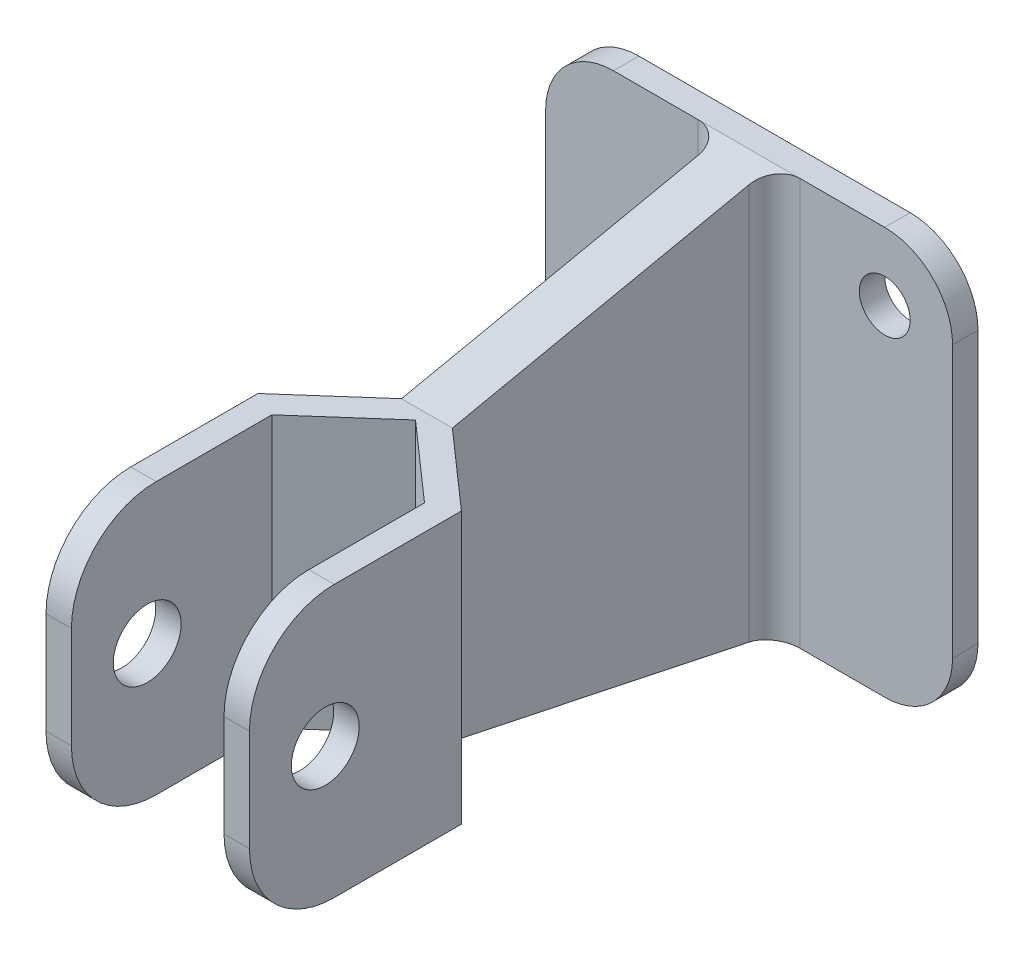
ISO-10303-21;
HEADER;
FILE_DESCRIPTION(('STEP AP214'),'2;1');
FILE_NAME('part.step','',(''),(''),'','','');
FILE_SCHEMA(('AUTOMOTIVE_DESIGN { 1 0 10303 214 1 1 1 1 }'));
ENDSEC;
DATA;
#1=APPLICATION_CONTEXT('core data for automotive mechanical design processes');
#2=APPLICATION_PROTOCOL_DEFINITION('international standard','automotive_design',2000,#1);
#3=PRODUCT_CONTEXT('',#1,'mechanical');
#4=PRODUCT('Part','Part','',(#3));
#5=PRODUCT_RELATED_PRODUCT_CATEGORY('part','',(#4));
#6=PRODUCT_DEFINITION_FORMATION('','',#4);
#7=PRODUCT_DEFINITION_CONTEXT('part definition',#1,'design');
#8=PRODUCT_DEFINITION('design','',#6,#7);
#9=PRODUCT_DEFINITION_SHAPE('','',#8);
#10=(LENGTH_UNIT() NAMED_UNIT(*) SI_UNIT(.MILLI.,.METRE.));
#11=(NAMED_UNIT(*) PLANE_ANGLE_UNIT() SI_UNIT($,.RADIAN.));
#12=(NAMED_UNIT(*) SI_UNIT($,.STERADIAN.) SOLID_ANGLE_UNIT());
#13=UNCERTAINTY_MEASURE_WITH_UNIT(LENGTH_MEASURE(1.E-05),#10,'distance_accuracy_value','');
#14=(GEOMETRIC_REPRESENTATION_CONTEXT(3) GLOBAL_UNCERTAINTY_ASSIGNED_CONTEXT((#13)) GLOBAL_UNIT_ASSIGNED_CONTEXT((#10,
#11,#12)) REPRESENTATION_CONTEXT('',''));
#15=CARTESIAN_POINT('',(0.,0.,0.));
#16=DIRECTION('',(0.,0.,1.));
#17=DIRECTION('',(1.,0.,0.));
#18=AXIS2_PLACEMENT_3D('',#15,#16,#17);
#19=CARTESIAN_POINT('',(0.,-48.,3.));
#20=DIRECTION('',(0.,0.,1.));
#21=DIRECTION('',(1.,0.,0.));
#22=AXIS2_PLACEMENT_3D('',#19,#20,#21);
#23=PLANE('',#22);
#24=CARTESIAN_POINT('',(8.00000000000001,-40.,3.));
#25=DIRECTION('',(0.,0.,1.));
#26=DIRECTION('',(1.,0.,0.));
#27=AXIS2_PLACEMENT_3D('',#24,#25,#26);
#28=CIRCLE('',#27,3.);
#29=CARTESIAN_POINT('',(11.,-40.,3.));
#30=VERTEX_POINT('',#29);
#31=EDGE_CURVE('E517',#30,#30,#28,.T.);
#32=ORIENTED_EDGE('',*,*,#31,.F.);
#33=EDGE_LOOP('',(#32));
#34=FACE_BOUND('',#33,.T.);
#35=DIRECTION('',(-1.,0.,0.));
#36=VECTOR('',#35,1.);
#37=CARTESIAN_POINT('',(0.,0.,3.));
#38=LINE('',#37,#36);
#39=CARTESIAN_POINT('',(18.,0.,3.));
#40=VERTEX_POINT('',#39);
#41=CARTESIAN_POINT('',(8.,0.,3.));
#42=VERTEX_POINT('',#41);
#43=EDGE_CURVE('E321',#40,#42,#38,.T.);
#44=ORIENTED_EDGE('',*,*,#43,.T.);
#45=CARTESIAN_POINT('',(8.,-8.,3.));
#46=DIRECTION('',(0.,0.,1.));
#47=DIRECTION('',(1.,0.,0.));
#48=AXIS2_PLACEMENT_3D('',#45,#46,#47);
#49=CIRCLE('',#48,8.);
#50=CARTESIAN_POINT('',(0.,-8.,3.));
#51=VERTEX_POINT('',#50);
#52=EDGE_CURVE('E11',#42,#51,#49,.T.);
#53=ORIENTED_EDGE('',*,*,#52,.T.);
#54=DIRECTION('',(0.,-1.,0.));
#55=VECTOR('',#54,1.);
#56=CARTESIAN_POINT('',(0.,0.,3.));
#57=LINE('',#56,#55);
#58=CARTESIAN_POINT('',(0.,-40.,3.));
#59=VERTEX_POINT('',#58);
#60=EDGE_CURVE('E343',#51,#59,#57,.T.);
#61=ORIENTED_EDGE('',*,*,#60,.T.);
#62=CARTESIAN_POINT('',(8.00000000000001,-40.,3.));
#63=DIRECTION('',(0.,0.,1.));
#64=DIRECTION('',(1.,0.,0.));
#65=AXIS2_PLACEMENT_3D('',#62,#63,#64);
#66=CIRCLE('',#65,8.);
#67=CARTESIAN_POINT('',(8.00000000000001,-48.,3.));
#68=VERTEX_POINT('',#67);
#69=EDGE_CURVE('E362',#59,#68,#66,.T.);
#70=ORIENTED_EDGE('',*,*,#69,.T.);
#71=DIRECTION('',(1.,0.,0.));
#72=VECTOR('',#71,1.);
#73=CARTESIAN_POINT('',(0.,-48.,3.));
#74=LINE('',#73,#72);
#75=CARTESIAN_POINT('',(18.,-48.,3.));
#76=VERTEX_POINT('',#75);
#77=EDGE_CURVE('E342',#68,#76,#74,.T.);
#78=ORIENTED_EDGE('',*,*,#77,.T.);
#79=DIRECTION('',(0.,1.,0.));
#80=VECTOR('',#79,1.);
#81=CARTESIAN_POINT('',(18.,-48.,3.));
#82=LINE('',#81,#80);
#83=EDGE_CURVE('E271',#76,#40,#82,.T.);
#84=ORIENTED_EDGE('',*,*,#83,.T.);
#85=EDGE_LOOP('',(#44,#53,#61,#70,#78,#84));
#86=FACE_BOUND('',#85,.T.);
#87=ADVANCED_FACE('F33',(#34,#86),#23,.T.);
#88=CARTESIAN_POINT('',(0.,0.,3.));
#89=DIRECTION('',(1.,0.,0.));
#90=DIRECTION('',(0.,1.,0.));
#91=AXIS2_PLACEMENT_3D('',#88,#89,#90);
#92=PLANE('',#91);
#93=ORIENTED_EDGE('',*,*,#60,.F.);
#94=DIRECTION('',(0.,0.,-1.));
#95=VECTOR('',#94,1.);
#96=CARTESIAN_POINT('',(0.,-8.,3.));
#97=LINE('',#96,#95);
#98=CARTESIAN_POINT('',(0.,-8.,0.));
#99=VERTEX_POINT('',#98);
#100=EDGE_CURVE('E364',#51,#99,#97,.T.);
#101=ORIENTED_EDGE('',*,*,#100,.T.);
#102=DIRECTION('',(0.,-1.,0.));
#103=VECTOR('',#102,1.);
#104=CARTESIAN_POINT('',(0.,0.,0.));
#105=LINE('',#104,#103);
#106=CARTESIAN_POINT('',(0.,-40.,0.));
#107=VERTEX_POINT('',#106);
#108=EDGE_CURVE('E370',#99,#107,#105,.T.);
#109=ORIENTED_EDGE('',*,*,#108,.T.);
#110=DIRECTION('',(0.,0.,-1.));
#111=VECTOR('',#110,1.);
#112=CARTESIAN_POINT('',(0.,-40.,3.));
#113=LINE('',#112,#111);
#114=EDGE_CURVE('E359',#107,#59,#113,.F.);
#115=ORIENTED_EDGE('',*,*,#114,.T.);
#116=EDGE_LOOP('',(#93,#101,#109,#115));
#117=FACE_BOUND('',#116,.T.);
#118=ADVANCED_FACE('F35',(#117),#92,.F.);
#119=CARTESIAN_POINT('',(0.,-48.,3.));
#120=DIRECTION('',(0.,1.,0.));
#121=DIRECTION('',(0.,0.,1.));
#122=AXIS2_PLACEMENT_3D('',#119,#120,#121);
#123=PLANE('',#122);
#124=ORIENTED_EDGE('',*,*,#77,.F.);
#125=DIRECTION('',(0.,0.,-1.));
#126=VECTOR('',#125,1.);
#127=CARTESIAN_POINT('',(8.00000000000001,-48.,3.));
#128=LINE('',#127,#126);
#129=CARTESIAN_POINT('',(8.00000000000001,-48.,0.));
#130=VERTEX_POINT('',#129);
#131=EDGE_CURVE('E353',#68,#130,#128,.T.);
#132=ORIENTED_EDGE('',*,*,#131,.T.);
#133=DIRECTION('',(1.,0.,0.));
#134=VECTOR('',#133,1.);
#135=CARTESIAN_POINT('',(0.,-48.,0.));
#136=LINE('',#135,#134);
#137=CARTESIAN_POINT('',(40.,-48.,0.));
#138=VERTEX_POINT('',#137);
#139=EDGE_CURVE('E376',#130,#138,#136,.T.);
#140=ORIENTED_EDGE('',*,*,#139,.T.);
#141=DIRECTION('',(0.,0.,-1.));
#142=VECTOR('',#141,1.);
#143=CARTESIAN_POINT('',(40.,-48.,3.));
#144=LINE('',#143,#142);
#145=CARTESIAN_POINT('',(40.,-48.,3.));
#146=VERTEX_POINT('',#145);
#147=EDGE_CURVE('E402',#138,#146,#144,.F.);
#148=ORIENTED_EDGE('',*,*,#147,.T.);
#149=CARTESIAN_POINT('',(30.,-48.,3.));
#150=VERTEX_POINT('',#149);
#151=EDGE_CURVE('E340',#150,#146,#74,.T.);
#152=ORIENTED_EDGE('',*,*,#151,.F.);
#153=DIRECTION('',(-1.,0.,0.));
#154=VECTOR('',#153,1.);
#155=CARTESIAN_POINT('',(27.,-48.,3.));
#156=LINE('',#155,#154);
#157=EDGE_CURVE('E377',#150,#76,#156,.T.);
#158=ORIENTED_EDGE('',*,*,#157,.T.);
#159=EDGE_LOOP('',(#124,#132,#140,#148,#152,#158));
#160=FACE_BOUND('',#159,.T.);
#161=ADVANCED_FACE('F393',(#160),#123,.F.);
#162=CARTESIAN_POINT('',(48.,0.,3.));
#163=DIRECTION('',(-1.,0.,0.));
#164=DIRECTION('',(0.,-1.,0.));
#165=AXIS2_PLACEMENT_3D('',#162,#163,#164);
#166=PLANE('',#165);
#167=DIRECTION('',(0.,1.,0.));
#168=VECTOR('',#167,1.);
#169=CARTESIAN_POINT('',(48.,0.,3.));
#170=LINE('',#169,#168);
#171=CARTESIAN_POINT('',(48.,-40.,3.));
#172=VERTEX_POINT('',#171);
#173=CARTESIAN_POINT('',(48.,-8.,3.));
#174=VERTEX_POINT('',#173);
#175=EDGE_CURVE('E326',#172,#174,#170,.T.);
#176=ORIENTED_EDGE('',*,*,#175,.F.);
#177=DIRECTION('',(0.,0.,-1.));
#178=VECTOR('',#177,1.);
#179=CARTESIAN_POINT('',(48.,-40.,3.));
#180=LINE('',#179,#178);
#181=CARTESIAN_POINT('',(48.,-40.,0.));
#182=VERTEX_POINT('',#181);
#183=EDGE_CURVE('E403',#172,#182,#180,.T.);
#184=ORIENTED_EDGE('',*,*,#183,.T.);
#185=DIRECTION('',(0.,1.,0.));
#186=VECTOR('',#185,1.);
#187=CARTESIAN_POINT('',(48.,0.,0.));
#188=LINE('',#187,#186);
#189=CARTESIAN_POINT('',(48.,-8.,0.));
#190=VERTEX_POINT('',#189);
#191=EDGE_CURVE('E379',#182,#190,#188,.T.);
#192=ORIENTED_EDGE('',*,*,#191,.T.);
#193=DIRECTION('',(0.,0.,-1.));
#194=VECTOR('',#193,1.);
#195=CARTESIAN_POINT('',(48.,-8.,3.));
#196=LINE('',#195,#194);
#197=EDGE_CURVE('E412',#190,#174,#196,.F.);
#198=ORIENTED_EDGE('',*,*,#197,.T.);
#199=EDGE_LOOP('',(#176,#184,#192,#198));
#200=FACE_BOUND('',#199,.T.);
#201=ADVANCED_FACE('F425',(#200),#166,.F.);
#202=CARTESIAN_POINT('',(0.,0.,3.));
#203=DIRECTION('',(0.,-1.,0.));
#204=DIRECTION('',(0.,0.,-1.));
#205=AXIS2_PLACEMENT_3D('',#202,#203,#204);
#206=PLANE('',#205);
#207=DIRECTION('',(-1.,0.,0.));
#208=VECTOR('',#207,1.);
#209=CARTESIAN_POINT('',(0.,0.,0.));
#210=LINE('',#209,#208);
#211=CARTESIAN_POINT('',(40.,0.,0.));
#212=VERTEX_POINT('',#211);
#213=CARTESIAN_POINT('',(8.,0.,0.));
#214=VERTEX_POINT('',#213);
#215=EDGE_CURVE('E384',#212,#214,#210,.T.);
#216=ORIENTED_EDGE('',*,*,#215,.T.);
#217=DIRECTION('',(0.,0.,-1.));
#218=VECTOR('',#217,1.);
#219=CARTESIAN_POINT('',(8.,0.,3.));
#220=LINE('',#219,#218);
#221=EDGE_CURVE('E41',#214,#42,#220,.F.);
#222=ORIENTED_EDGE('',*,*,#221,.T.);
#223=ORIENTED_EDGE('',*,*,#43,.F.);
#224=DIRECTION('',(-1.,0.,0.));
#225=VECTOR('',#224,1.);
#226=CARTESIAN_POINT('',(27.,0.,3.));
#227=LINE('',#226,#225);
#228=CARTESIAN_POINT('',(30.,0.,3.));
#229=VERTEX_POINT('',#228);
#230=EDGE_CURVE('E328',#229,#40,#227,.T.);
#231=ORIENTED_EDGE('',*,*,#230,.F.);
#232=CARTESIAN_POINT('',(40.,0.,3.));
#233=VERTEX_POINT('',#232);
#234=EDGE_CURVE('E317',#233,#229,#38,.T.);
#235=ORIENTED_EDGE('',*,*,#234,.F.);
#236=DIRECTION('',(0.,0.,-1.));
#237=VECTOR('',#236,1.);
#238=CARTESIAN_POINT('',(40.,0.,3.));
#239=LINE('',#238,#237);
#240=EDGE_CURVE('E316',#233,#212,#239,.T.);
#241=ORIENTED_EDGE('',*,*,#240,.T.);
#242=EDGE_LOOP('',(#216,#222,#223,#231,#235,#241));
#243=FACE_BOUND('',#242,.T.);
#244=ADVANCED_FACE('F418',(#243),#206,.F.);
#245=CARTESIAN_POINT('',(40.,-8.,3.));
#246=DIRECTION('',(0.,0.,1.));
#247=DIRECTION('',(1.,0.,0.));
#248=AXIS2_PLACEMENT_3D('',#245,#246,#247);
#249=CIRCLE('',#248,3.);
#250=CARTESIAN_POINT('',(43.,-8.,3.));
#251=VERTEX_POINT('',#250);
#252=EDGE_CURVE('E511',#251,#251,#249,.T.);
#253=ORIENTED_EDGE('',*,*,#252,.F.);
#254=EDGE_LOOP('',(#253));
#255=FACE_BOUND('',#254,.T.);
#256=ORIENTED_EDGE('',*,*,#151,.T.);
#257=CARTESIAN_POINT('',(40.,-40.,3.));
#258=DIRECTION('',(0.,0.,1.));
#259=DIRECTION('',(1.,0.,0.));
#260=AXIS2_PLACEMENT_3D('',#257,#258,#259);
#261=CIRCLE('',#260,8.);
#262=EDGE_CURVE('E351',#146,#172,#261,.T.);
#263=ORIENTED_EDGE('',*,*,#262,.T.);
#264=ORIENTED_EDGE('',*,*,#175,.T.);
#265=CARTESIAN_POINT('',(40.,-8.,3.));
#266=DIRECTION('',(0.,0.,1.));
#267=DIRECTION('',(1.,0.,0.));
#268=AXIS2_PLACEMENT_3D('',#265,#266,#267);
#269=CIRCLE('',#268,8.);
#270=EDGE_CURVE('E410',#174,#233,#269,.T.);
#271=ORIENTED_EDGE('',*,*,#270,.T.);
#272=ORIENTED_EDGE('',*,*,#234,.T.);
#273=DIRECTION('',(0.,1.,0.));
#274=VECTOR('',#273,1.);
#275=CARTESIAN_POINT('',(30.,-48.,3.));
#276=LINE('',#275,#274);
#277=EDGE_CURVE('E337',#229,#150,#276,.F.);
#278=ORIENTED_EDGE('',*,*,#277,.T.);
#279=EDGE_LOOP('',(#256,#263,#264,#271,#272,#278));
#280=FACE_BOUND('',#279,.T.);
#281=ADVANCED_FACE('F427',(#255,#280),#23,.T.);
#282=CARTESIAN_POINT('',(0.,-48.,0.));
#283=DIRECTION('',(0.,0.,1.));
#284=DIRECTION('',(1.,0.,0.));
#285=AXIS2_PLACEMENT_3D('',#282,#283,#284);
#286=PLANE('',#285);
#287=CARTESIAN_POINT('',(8.00000000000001,-40.,0.));
#288=DIRECTION('',(0.,0.,1.));
#289=DIRECTION('',(1.,0.,0.));
#290=AXIS2_PLACEMENT_3D('',#287,#288,#289);
#291=CIRCLE('',#290,3.);
#292=CARTESIAN_POINT('',(11.,-40.,0.));
#293=VERTEX_POINT('',#292);
#294=EDGE_CURVE('E514',#293,#293,#291,.T.);
#295=ORIENTED_EDGE('',*,*,#294,.T.);
#296=EDGE_LOOP('',(#295));
#297=FACE_BOUND('',#296,.T.);
#298=CARTESIAN_POINT('',(40.,-8.,0.));
#299=DIRECTION('',(0.,0.,1.));
#300=DIRECTION('',(1.,0.,0.));
#301=AXIS2_PLACEMENT_3D('',#298,#299,#300);
#302=CIRCLE('',#301,3.);
#303=CARTESIAN_POINT('',(43.,-8.,0.));
#304=VERTEX_POINT('',#303);
#305=EDGE_CURVE('E508',#304,#304,#302,.T.);
#306=ORIENTED_EDGE('',*,*,#305,.T.);
#307=EDGE_LOOP('',(#306));
#308=FACE_BOUND('',#307,.T.);
#309=ORIENTED_EDGE('',*,*,#108,.F.);
#310=CARTESIAN_POINT('',(8.,-8.,0.));
#311=DIRECTION('',(0.,0.,1.));
#312=DIRECTION('',(1.,0.,0.));
#313=AXIS2_PLACEMENT_3D('',#310,#311,#312);
#314=CIRCLE('',#313,8.);
#315=EDGE_CURVE('E55',#99,#214,#314,.F.);
#316=ORIENTED_EDGE('',*,*,#315,.T.);
#317=ORIENTED_EDGE('',*,*,#215,.F.);
#318=CARTESIAN_POINT('',(40.,-8.,0.));
#319=DIRECTION('',(0.,0.,1.));
#320=DIRECTION('',(1.,0.,0.));
#321=AXIS2_PLACEMENT_3D('',#318,#319,#320);
#322=CIRCLE('',#321,8.);
#323=EDGE_CURVE('E414',#212,#190,#322,.F.);
#324=ORIENTED_EDGE('',*,*,#323,.T.);
#325=ORIENTED_EDGE('',*,*,#191,.F.);
#326=CARTESIAN_POINT('',(40.,-40.,0.));
#327=DIRECTION('',(0.,0.,1.));
#328=DIRECTION('',(1.,0.,0.));
#329=AXIS2_PLACEMENT_3D('',#326,#327,#328);
#330=CIRCLE('',#329,8.);
#331=EDGE_CURVE('E396',#182,#138,#330,.F.);
#332=ORIENTED_EDGE('',*,*,#331,.T.);
#333=ORIENTED_EDGE('',*,*,#139,.F.);
#334=CARTESIAN_POINT('',(8.00000000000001,-40.,0.));
#335=DIRECTION('',(0.,0.,1.));
#336=DIRECTION('',(1.,0.,0.));
#337=AXIS2_PLACEMENT_3D('',#334,#335,#336);
#338=CIRCLE('',#337,8.);
#339=EDGE_CURVE('E356',#130,#107,#338,.F.);
#340=ORIENTED_EDGE('',*,*,#339,.T.);
#341=EDGE_LOOP('',(#309,#316,#317,#324,#325,#332,#333,#340));
#342=FACE_BOUND('',#341,.T.);
#343=ADVANCED_FACE('F373',(#297,#308,#342),#286,.F.);
#344=CARTESIAN_POINT('',(27.,-40.,41.));
#345=DIRECTION('',(0.,0.978549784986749,-0.206010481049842));
#346=DIRECTION('',(0.,0.206010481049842,0.978549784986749));
#347=AXIS2_PLACEMENT_3D('',#344,#345,#346);
#348=PLANE('',#347);
#349=DIRECTION('',(-1.,0.,0.));
#350=VECTOR('',#349,1.);
#351=CARTESIAN_POINT('',(27.,-40.,41.));
#352=LINE('',#351,#350);
#353=CARTESIAN_POINT('',(27.,-40.,41.));
#354=VERTEX_POINT('',#353);
#355=CARTESIAN_POINT('',(21.,-40.,41.));
#356=VERTEX_POINT('',#355);
#357=EDGE_CURVE('E232',#354,#356,#352,.T.);
#358=ORIENTED_EDGE('',*,*,#357,.T.);
#359=DIRECTION('',(0.,-0.206010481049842,-0.978549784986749));
#360=VECTOR('',#359,1.);
#361=CARTESIAN_POINT('',(21.,-40.,41.));
#362=LINE('',#361,#360);
#363=CARTESIAN_POINT('',(21.,-47.3684210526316,5.99999999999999));
#364=VERTEX_POINT('',#363);
#365=EDGE_CURVE('E243',#356,#364,#362,.T.);
#366=ORIENTED_EDGE('',*,*,#365,.T.);
#367=CARTESIAN_POINT('',(18.,-47.3684210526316,6.));
#368=DIRECTION('',(0.,0.978549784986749,-0.206010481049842));
#369=DIRECTION('',(0.,0.206010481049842,0.978549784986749));
#370=AXIS2_PLACEMENT_3D('',#367,#368,#369);
#371=ELLIPSE('',#370,3.06576123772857,3.);
#372=EDGE_CURVE('E276',#364,#76,#371,.T.);
#373=ORIENTED_EDGE('',*,*,#372,.T.);
#374=ORIENTED_EDGE('',*,*,#157,.F.);
#375=CARTESIAN_POINT('',(30.,-47.3684210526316,6.));
#376=DIRECTION('',(0.,0.978549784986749,-0.206010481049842));
#377=DIRECTION('',(0.,-0.206010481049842,-0.978549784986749));
#378=AXIS2_PLACEMENT_3D('',#375,#376,#377);
#379=ELLIPSE('',#378,3.06576123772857,3.);
#380=CARTESIAN_POINT('',(27.,-47.3684210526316,5.99999999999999));
#381=VERTEX_POINT('',#380);
#382=EDGE_CURVE('E332',#150,#381,#379,.T.);
#383=ORIENTED_EDGE('',*,*,#382,.T.);
#384=DIRECTION('',(0.,-0.206010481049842,-0.978549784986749));
#385=VECTOR('',#384,1.);
#386=CARTESIAN_POINT('',(27.,-40.,41.));
#387=LINE('',#386,#385);
#388=EDGE_CURVE('E222',#354,#381,#387,.T.);
#389=ORIENTED_EDGE('',*,*,#388,.F.);
#390=EDGE_LOOP('',(#358,#366,#373,#374,#383,#389));
#391=FACE_BOUND('',#390,.T.);
#392=ADVANCED_FACE('F241',(#391),#348,.F.);
#393=CARTESIAN_POINT('',(27.,-8.,41.));
#394=DIRECTION('',(0.,-0.978549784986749,-0.206010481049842));
#395=DIRECTION('',(0.,0.206010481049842,-0.978549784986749));
#396=AXIS2_PLACEMENT_3D('',#393,#394,#395);
#397=PLANE('',#396);
#398=ORIENTED_EDGE('',*,*,#230,.T.);
#399=CARTESIAN_POINT('',(18.,-0.631578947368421,6.));
#400=DIRECTION('',(0.,-0.978549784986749,-0.206010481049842));
#401=DIRECTION('',(0.,0.206010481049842,-0.978549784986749));
#402=AXIS2_PLACEMENT_3D('',#399,#400,#401);
#403=ELLIPSE('',#402,3.06576123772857,3.);
#404=CARTESIAN_POINT('',(21.,-0.63157894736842,5.99999999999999));
#405=VERTEX_POINT('',#404);
#406=EDGE_CURVE('E274',#40,#405,#403,.T.);
#407=ORIENTED_EDGE('',*,*,#406,.T.);
#408=DIRECTION('',(0.,-0.206010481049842,0.978549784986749));
#409=VECTOR('',#408,1.);
#410=CARTESIAN_POINT('',(21.,-8.,41.));
#411=LINE('',#410,#409);
#412=CARTESIAN_POINT('',(21.,-8.,41.));
#413=VERTEX_POINT('',#412);
#414=EDGE_CURVE('E223',#405,#413,#411,.T.);
#415=ORIENTED_EDGE('',*,*,#414,.T.);
#416=DIRECTION('',(-1.,0.,0.));
#417=VECTOR('',#416,1.);
#418=CARTESIAN_POINT('',(27.,-8.,41.));
#419=LINE('',#418,#417);
#420=CARTESIAN_POINT('',(27.,-8.,41.));
#421=VERTEX_POINT('',#420);
#422=EDGE_CURVE('E246',#421,#413,#419,.T.);
#423=ORIENTED_EDGE('',*,*,#422,.F.);
#424=DIRECTION('',(0.,-0.206010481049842,0.978549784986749));
#425=VECTOR('',#424,1.);
#426=CARTESIAN_POINT('',(27.,-8.,41.));
#427=LINE('',#426,#425);
#428=CARTESIAN_POINT('',(27.,-0.63157894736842,5.99999999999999));
#429=VERTEX_POINT('',#428);
#430=EDGE_CURVE('E266',#429,#421,#427,.T.);
#431=ORIENTED_EDGE('',*,*,#430,.F.);
#432=CARTESIAN_POINT('',(30.,-0.631578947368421,6.));
#433=DIRECTION('',(0.,-0.978549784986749,-0.206010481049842));
#434=DIRECTION('',(0.,-0.206010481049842,0.978549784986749));
#435=AXIS2_PLACEMENT_3D('',#432,#433,#434);
#436=ELLIPSE('',#435,3.06576123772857,3.);
#437=EDGE_CURVE('E334',#429,#229,#436,.T.);
#438=ORIENTED_EDGE('',*,*,#437,.T.);
#439=EDGE_LOOP('',(#398,#407,#415,#423,#431,#438));
#440=FACE_BOUND('',#439,.T.);
#441=ADVANCED_FACE('F626',(#440),#397,.F.);
#442=CARTESIAN_POINT('',(27.,-48.,3.));
#443=DIRECTION('',(1.,0.,0.));
#444=DIRECTION('',(0.,0.,-1.));
#445=AXIS2_PLACEMENT_3D('',#442,#443,#444);
#446=PLANE('',#445);
#447=ORIENTED_EDGE('',*,*,#388,.T.);
#448=DIRECTION('',(0.,1.,0.));
#449=VECTOR('',#448,1.);
#450=CARTESIAN_POINT('',(27.,0.,6.));
#451=LINE('',#450,#449);
#452=EDGE_CURVE('E320',#381,#429,#451,.T.);
#453=ORIENTED_EDGE('',*,*,#452,.T.);
#454=ORIENTED_EDGE('',*,*,#430,.T.);
#455=DIRECTION('',(0.,-1.,0.));
#456=VECTOR('',#455,1.);
#457=CARTESIAN_POINT('',(27.,-40.,41.));
#458=LINE('',#457,#456);
#459=EDGE_CURVE('E247',#421,#354,#458,.T.);
#460=ORIENTED_EDGE('',*,*,#459,.T.);
#461=EDGE_LOOP('',(#447,#453,#454,#460));
#462=FACE_BOUND('',#461,.T.);
#463=ADVANCED_FACE('F435',(#462),#446,.T.);
#464=CARTESIAN_POINT('',(21.,-48.,3.));
#465=DIRECTION('',(1.,0.,0.));
#466=DIRECTION('',(0.,0.,-1.));
#467=AXIS2_PLACEMENT_3D('',#464,#465,#466);
#468=PLANE('',#467);
#469=ORIENTED_EDGE('',*,*,#414,.F.);
#470=DIRECTION('',(0.,1.,0.));
#471=VECTOR('',#470,1.);
#472=CARTESIAN_POINT('',(21.,-48.,6.));
#473=LINE('',#472,#471);
#474=EDGE_CURVE('E251',#405,#364,#473,.F.);
#475=ORIENTED_EDGE('',*,*,#474,.T.);
#476=ORIENTED_EDGE('',*,*,#365,.F.);
#477=DIRECTION('',(0.,-1.,0.));
#478=VECTOR('',#477,1.);
#479=CARTESIAN_POINT('',(21.,-40.,41.));
#480=LINE('',#479,#478);
#481=EDGE_CURVE('E212',#413,#356,#480,.T.);
#482=ORIENTED_EDGE('',*,*,#481,.F.);
#483=EDGE_LOOP('',(#469,#475,#476,#482));
#484=FACE_BOUND('',#483,.T.);
#485=ADVANCED_FACE('F249',(#484),#468,.F.);
#486=CARTESIAN_POINT('',(30.,-48.,6.));
#487=DIRECTION('',(0.,-1.,0.));
#488=DIRECTION('',(0.,0.,-1.));
#489=AXIS2_PLACEMENT_3D('',#486,#487,#488);
#490=CYLINDRICAL_SURFACE('',#489,3.);
#491=ORIENTED_EDGE('',*,*,#382,.F.);
#492=ORIENTED_EDGE('',*,*,#277,.F.);
#493=ORIENTED_EDGE('',*,*,#437,.F.);
#494=ORIENTED_EDGE('',*,*,#452,.F.);
#495=EDGE_LOOP('',(#491,#492,#493,#494));
#496=FACE_BOUND('',#495,.T.);
#497=ADVANCED_FACE('F432',(#496),#490,.F.);
#498=CARTESIAN_POINT('',(18.,-48.,6.));
#499=DIRECTION('',(0.,1.,0.));
#500=DIRECTION('',(0.,0.,1.));
#501=AXIS2_PLACEMENT_3D('',#498,#499,#500);
#502=CYLINDRICAL_SURFACE('',#501,3.);
#503=ORIENTED_EDGE('',*,*,#372,.F.);
#504=ORIENTED_EDGE('',*,*,#474,.F.);
#505=ORIENTED_EDGE('',*,*,#406,.F.);
#506=ORIENTED_EDGE('',*,*,#83,.F.);
#507=EDGE_LOOP('',(#503,#504,#505,#506));
#508=FACE_BOUND('',#507,.T.);
#509=ADVANCED_FACE('F616',(#508),#502,.F.);
#510=CARTESIAN_POINT('',(21.,-8.,41.));
#511=DIRECTION('',(0.661437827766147,0.,0.750000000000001));
#512=DIRECTION('',(0.750000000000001,0.,-0.661437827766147));
#513=AXIS2_PLACEMENT_3D('',#510,#511,#512);
#514=PLANE('',#513);
#515=ORIENTED_EDGE('',*,*,#481,.T.);
#516=DIRECTION('',(-0.750000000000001,0.,0.661437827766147));
#517=VECTOR('',#516,1.);
#518=CARTESIAN_POINT('',(21.,-40.,41.));
#519=LINE('',#518,#517);
#520=CARTESIAN_POINT('',(12.,-40.,48.9372539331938));
#521=VERTEX_POINT('',#520);
#522=EDGE_CURVE('E216',#356,#521,#519,.T.);
#523=ORIENTED_EDGE('',*,*,#522,.T.);
#524=DIRECTION('',(0.,-1.,0.));
#525=VECTOR('',#524,1.);
#526=CARTESIAN_POINT('',(12.,-8.,48.9372539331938));
#527=LINE('',#526,#525);
#528=CARTESIAN_POINT('',(12.,-8.,48.9372539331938));
#529=VERTEX_POINT('',#528);
#530=EDGE_CURVE('E252',#529,#521,#527,.T.);
#531=ORIENTED_EDGE('',*,*,#530,.F.);
#532=DIRECTION('',(-0.750000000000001,0.,0.661437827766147));
#533=VECTOR('',#532,1.);
#534=CARTESIAN_POINT('',(21.,-8.,41.));
#535=LINE('',#534,#533);
#536=EDGE_CURVE('E217',#413,#529,#535,.T.);
#537=ORIENTED_EDGE('',*,*,#536,.F.);
#538=EDGE_LOOP('',(#515,#523,#531,#537));
#539=FACE_BOUND('',#538,.T.);
#540=ADVANCED_FACE('F214',(#539),#514,.F.);
#541=CARTESIAN_POINT('',(12.,-8.,48.9372539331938));
#542=DIRECTION('',(1.,0.,0.));
#543=DIRECTION('',(0.,0.,-1.));
#544=AXIS2_PLACEMENT_3D('',#541,#542,#543);
#545=PLANE('',#544);
#546=CARTESIAN_POINT('',(12.,-24.,65.));
#547=DIRECTION('',(1.,0.,0.));
#548=DIRECTION('',(0.,0.,-1.));
#549=AXIS2_PLACEMENT_3D('',#546,#547,#548);
#550=CIRCLE('',#549,4.00000000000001);
#551=CARTESIAN_POINT('',(12.,-24.,61.));
#552=VERTEX_POINT('',#551);
#553=EDGE_CURVE('E236',#552,#552,#550,.T.);
#554=ORIENTED_EDGE('',*,*,#553,.T.);
#555=EDGE_LOOP('',(#554));
#556=FACE_BOUND('',#555,.T.);
#557=DIRECTION('',(0.,-1.,0.));
#558=VECTOR('',#557,1.);
#559=CARTESIAN_POINT('',(12.,-8.,73.9372539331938));
#560=LINE('',#559,#558);
#561=CARTESIAN_POINT('',(12.,-18.,73.9372539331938));
#562=VERTEX_POINT('',#561);
#563=CARTESIAN_POINT('',(12.,-30.,73.9372539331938));
#564=VERTEX_POINT('',#563);
#565=EDGE_CURVE('E256',#562,#564,#560,.T.);
#566=ORIENTED_EDGE('',*,*,#565,.F.);
#567=CARTESIAN_POINT('',(12.,-18.,63.9372539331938));
#568=DIRECTION('',(1.,0.,0.));
#569=DIRECTION('',(0.,0.,-1.));
#570=AXIS2_PLACEMENT_3D('',#567,#568,#569);
#571=CIRCLE('',#570,10.);
#572=CARTESIAN_POINT('',(12.,-8.,63.9372539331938));
#573=VERTEX_POINT('',#572);
#574=EDGE_CURVE('E305',#562,#573,#571,.F.);
#575=ORIENTED_EDGE('',*,*,#574,.T.);
#576=DIRECTION('',(0.,0.,1.));
#577=VECTOR('',#576,1.);
#578=CARTESIAN_POINT('',(12.,-8.,48.9372539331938));
#579=LINE('',#578,#577);
#580=EDGE_CURVE('E477',#529,#573,#579,.T.);
#581=ORIENTED_EDGE('',*,*,#580,.F.);
#582=ORIENTED_EDGE('',*,*,#530,.T.);
#583=DIRECTION('',(0.,0.,1.));
#584=VECTOR('',#583,1.);
#585=CARTESIAN_POINT('',(12.,-40.,48.9372539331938));
#586=LINE('',#585,#584);
#587=CARTESIAN_POINT('',(12.,-40.,63.9372539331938));
#588=VERTEX_POINT('',#587);
#589=EDGE_CURVE('E235',#521,#588,#586,.T.);
#590=ORIENTED_EDGE('',*,*,#589,.T.);
#591=CARTESIAN_POINT('',(12.,-30.,63.9372539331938));
#592=DIRECTION('',(1.,0.,0.));
#593=DIRECTION('',(0.,0.,-1.));
#594=AXIS2_PLACEMENT_3D('',#591,#592,#593);
#595=CIRCLE('',#594,10.);
#596=EDGE_CURVE('E285',#588,#564,#595,.F.);
#597=ORIENTED_EDGE('',*,*,#596,.T.);
#598=EDGE_LOOP('',(#566,#575,#581,#582,#590,#597));
#599=FACE_BOUND('',#598,.T.);
#600=ADVANCED_FACE('F609',(#556,#599),#545,.F.);
#601=CARTESIAN_POINT('',(12.,-8.,73.9372539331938));
#602=DIRECTION('',(0.,0.,-1.));
#603=DIRECTION('',(-1.,0.,0.));
#604=AXIS2_PLACEMENT_3D('',#601,#602,#603);
#605=PLANE('',#604);
#606=DIRECTION('',(0.,-1.,0.));
#607=VECTOR('',#606,1.);
#608=CARTESIAN_POINT('',(15.,-8.,73.9372539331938));
#609=LINE('',#608,#607);
#610=CARTESIAN_POINT('',(15.,-18.,73.9372539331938));
#611=VERTEX_POINT('',#610);
#612=CARTESIAN_POINT('',(15.,-30.,73.9372539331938));
#613=VERTEX_POINT('',#612);
#614=EDGE_CURVE('E448',#611,#613,#609,.T.);
#615=ORIENTED_EDGE('',*,*,#614,.F.);
#616=DIRECTION('',(1.,0.,0.));
#617=VECTOR('',#616,1.);
#618=CARTESIAN_POINT('',(12.,-18.,73.9372539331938));
#619=LINE('',#618,#617);
#620=EDGE_CURVE('E303',#611,#562,#619,.F.);
#621=ORIENTED_EDGE('',*,*,#620,.T.);
#622=ORIENTED_EDGE('',*,*,#565,.T.);
#623=DIRECTION('',(1.,0.,0.));
#624=VECTOR('',#623,1.);
#625=CARTESIAN_POINT('',(15.,-30.,73.9372539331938));
#626=LINE('',#625,#624);
#627=EDGE_CURVE('E278',#564,#613,#626,.T.);
#628=ORIENTED_EDGE('',*,*,#627,.T.);
#629=EDGE_LOOP('',(#615,#621,#622,#628));
#630=FACE_BOUND('',#629,.T.);
#631=ADVANCED_FACE('F605',(#630),#605,.F.);
#632=CARTESIAN_POINT('',(15.,-8.,73.9372539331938));
#633=DIRECTION('',(-1.,0.,0.));
#634=DIRECTION('',(0.,0.,1.));
#635=AXIS2_PLACEMENT_3D('',#632,#633,#634);
#636=PLANE('',#635);
#637=CARTESIAN_POINT('',(15.,-24.,65.));
#638=DIRECTION('',(-1.,0.,0.));
#639=DIRECTION('',(0.,0.,1.));
#640=AXIS2_PLACEMENT_3D('',#637,#638,#639);
#641=CIRCLE('',#640,4.00000000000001);
#642=CARTESIAN_POINT('',(15.,-24.,69.));
#643=VERTEX_POINT('',#642);
#644=EDGE_CURVE('E499',#643,#643,#641,.T.);
#645=ORIENTED_EDGE('',*,*,#644,.T.);
#646=EDGE_LOOP('',(#645));
#647=FACE_BOUND('',#646,.T.);
#648=DIRECTION('',(0.,0.,-1.));
#649=VECTOR('',#648,1.);
#650=CARTESIAN_POINT('',(15.,-8.,73.9372539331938));
#651=LINE('',#650,#649);
#652=CARTESIAN_POINT('',(15.,-8.,63.9372539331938));
#653=VERTEX_POINT('',#652);
#654=CARTESIAN_POINT('',(15.,-8.,50.2915026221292));
#655=VERTEX_POINT('',#654);
#656=EDGE_CURVE('E475',#653,#655,#651,.T.);
#657=ORIENTED_EDGE('',*,*,#656,.F.);
#658=CARTESIAN_POINT('',(15.,-18.,63.9372539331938));
#659=DIRECTION('',(-1.,0.,0.));
#660=DIRECTION('',(0.,0.,1.));
#661=AXIS2_PLACEMENT_3D('',#658,#659,#660);
#662=CIRCLE('',#661,10.);
#663=EDGE_CURVE('E301',#653,#611,#662,.F.);
#664=ORIENTED_EDGE('',*,*,#663,.T.);
#665=ORIENTED_EDGE('',*,*,#614,.T.);
#666=CARTESIAN_POINT('',(15.,-30.,63.9372539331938));
#667=DIRECTION('',(-1.,0.,0.));
#668=DIRECTION('',(0.,0.,1.));
#669=AXIS2_PLACEMENT_3D('',#666,#667,#668);
#670=CIRCLE('',#669,10.);
#671=CARTESIAN_POINT('',(15.,-40.,63.9372539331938));
#672=VERTEX_POINT('',#671);
#673=EDGE_CURVE('E281',#613,#672,#670,.F.);
#674=ORIENTED_EDGE('',*,*,#673,.T.);
#675=DIRECTION('',(0.,0.,-1.));
#676=VECTOR('',#675,1.);
#677=CARTESIAN_POINT('',(15.,-40.,73.9372539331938));
#678=LINE('',#677,#676);
#679=CARTESIAN_POINT('',(15.,-40.,50.2915026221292));
#680=VERTEX_POINT('',#679);
#681=EDGE_CURVE('E494',#672,#680,#678,.T.);
#682=ORIENTED_EDGE('',*,*,#681,.T.);
#683=DIRECTION('',(0.,-1.,0.));
#684=VECTOR('',#683,1.);
#685=CARTESIAN_POINT('',(15.,-8.,50.2915026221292));
#686=LINE('',#685,#684);
#687=EDGE_CURVE('E450',#655,#680,#686,.T.);
#688=ORIENTED_EDGE('',*,*,#687,.F.);
#689=EDGE_LOOP('',(#657,#664,#665,#674,#682,#688));
#690=FACE_BOUND('',#689,.T.);
#691=ADVANCED_FACE('F601',(#647,#690),#636,.F.);
#692=CARTESIAN_POINT('',(15.,-8.,50.2915026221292));
#693=DIRECTION('',(-0.661437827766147,0.,-0.750000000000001));
#694=DIRECTION('',(-0.75,0.,0.661437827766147));
#695=AXIS2_PLACEMENT_3D('',#692,#693,#694);
#696=PLANE('',#695);
#697=ORIENTED_EDGE('',*,*,#687,.T.);
#698=DIRECTION('',(0.75,0.,-0.661437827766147));
#699=VECTOR('',#698,1.);
#700=CARTESIAN_POINT('',(15.,-40.,50.2915026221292));
#701=LINE('',#700,#699);
#702=CARTESIAN_POINT('',(24.,-40.,42.3542486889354));
#703=VERTEX_POINT('',#702);
#704=EDGE_CURVE('E491',#680,#703,#701,.T.);
#705=ORIENTED_EDGE('',*,*,#704,.T.);
#706=DIRECTION('',(0.,-1.,0.));
#707=VECTOR('',#706,1.);
#708=CARTESIAN_POINT('',(24.,-8.,42.3542486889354));
#709=LINE('',#708,#707);
#710=CARTESIAN_POINT('',(24.,-8.,42.3542486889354));
#711=VERTEX_POINT('',#710);
#712=EDGE_CURVE('E453',#711,#703,#709,.T.);
#713=ORIENTED_EDGE('',*,*,#712,.F.);
#714=DIRECTION('',(0.75,0.,-0.661437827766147));
#715=VECTOR('',#714,1.);
#716=CARTESIAN_POINT('',(15.,-8.,50.2915026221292));
#717=LINE('',#716,#715);
#718=EDGE_CURVE('E473',#655,#711,#717,.T.);
#719=ORIENTED_EDGE('',*,*,#718,.F.);
#720=EDGE_LOOP('',(#697,#705,#713,#719));
#721=FACE_BOUND('',#720,.T.);
#722=ADVANCED_FACE('F597',(#721),#696,.F.);
#723=CARTESIAN_POINT('',(33.,-8.,50.2915026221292));
#724=DIRECTION('',(0.661437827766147,0.,-0.75));
#725=DIRECTION('',(-0.75,0.,-0.661437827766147));
#726=AXIS2_PLACEMENT_3D('',#723,#724,#725);
#727=PLANE('',#726);
#728=ORIENTED_EDGE('',*,*,#712,.T.);
#729=DIRECTION('',(0.75,0.,0.661437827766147));
#730=VECTOR('',#729,1.);
#731=CARTESIAN_POINT('',(33.,-40.,50.2915026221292));
#732=LINE('',#731,#730);
#733=CARTESIAN_POINT('',(33.,-40.,50.2915026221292));
#734=VERTEX_POINT('',#733);
#735=EDGE_CURVE('E488',#703,#734,#732,.T.);
#736=ORIENTED_EDGE('',*,*,#735,.T.);
#737=DIRECTION('',(0.,-1.,0.));
#738=VECTOR('',#737,1.);
#739=CARTESIAN_POINT('',(33.,-8.,50.2915026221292));
#740=LINE('',#739,#738);
#741=CARTESIAN_POINT('',(33.,-8.,50.2915026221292));
#742=VERTEX_POINT('',#741);
#743=EDGE_CURVE('E455',#742,#734,#740,.T.);
#744=ORIENTED_EDGE('',*,*,#743,.F.);
#745=DIRECTION('',(0.75,0.,0.661437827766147));
#746=VECTOR('',#745,1.);
#747=CARTESIAN_POINT('',(33.,-8.,50.2915026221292));
#748=LINE('',#747,#746);
#749=EDGE_CURVE('E471',#711,#742,#748,.T.);
#750=ORIENTED_EDGE('',*,*,#749,.F.);
#751=EDGE_LOOP('',(#728,#736,#744,#750));
#752=FACE_BOUND('',#751,.T.);
#753=ADVANCED_FACE('F593',(#752),#727,.F.);
#754=CARTESIAN_POINT('',(33.,-8.,73.9372539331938));
#755=DIRECTION('',(1.,0.,0.));
#756=DIRECTION('',(0.,0.,-1.));
#757=AXIS2_PLACEMENT_3D('',#754,#755,#756);
#758=PLANE('',#757);
#759=CARTESIAN_POINT('',(33.,-24.,65.));
#760=DIRECTION('',(1.,0.,0.));
#761=DIRECTION('',(0.,0.,-1.));
#762=AXIS2_PLACEMENT_3D('',#759,#760,#761);
#763=CIRCLE('',#762,4.00000000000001);
#764=CARTESIAN_POINT('',(33.,-24.,61.));
#765=VERTEX_POINT('',#764);
#766=EDGE_CURVE('E502',#765,#765,#763,.T.);
#767=ORIENTED_EDGE('',*,*,#766,.T.);
#768=EDGE_LOOP('',(#767));
#769=FACE_BOUND('',#768,.T.);
#770=DIRECTION('',(0.,-1.,0.));
#771=VECTOR('',#770,1.);
#772=CARTESIAN_POINT('',(33.,-8.,73.9372539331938));
#773=LINE('',#772,#771);
#774=CARTESIAN_POINT('',(33.,-18.,73.9372539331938));
#775=VERTEX_POINT('',#774);
#776=CARTESIAN_POINT('',(33.,-30.,73.9372539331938));
#777=VERTEX_POINT('',#776);
#778=EDGE_CURVE('E457',#775,#777,#773,.T.);
#779=ORIENTED_EDGE('',*,*,#778,.F.);
#780=CARTESIAN_POINT('',(33.,-18.,63.9372539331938));
#781=DIRECTION('',(1.,0.,0.));
#782=DIRECTION('',(0.,0.,-1.));
#783=AXIS2_PLACEMENT_3D('',#780,#781,#782);
#784=CIRCLE('',#783,10.);
#785=CARTESIAN_POINT('',(33.,-8.,63.9372539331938));
#786=VERTEX_POINT('',#785);
#787=EDGE_CURVE('E314',#775,#786,#784,.F.);
#788=ORIENTED_EDGE('',*,*,#787,.T.);
#789=DIRECTION('',(0.,0.,1.));
#790=VECTOR('',#789,1.);
#791=CARTESIAN_POINT('',(33.,-8.,73.9372539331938));
#792=LINE('',#791,#790);
#793=EDGE_CURVE('E468',#742,#786,#792,.T.);
#794=ORIENTED_EDGE('',*,*,#793,.F.);
#795=ORIENTED_EDGE('',*,*,#743,.T.);
#796=DIRECTION('',(0.,0.,1.));
#797=VECTOR('',#796,1.);
#798=CARTESIAN_POINT('',(33.,-40.,73.9372539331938));
#799=LINE('',#798,#797);
#800=CARTESIAN_POINT('',(33.,-40.,63.9372539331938));
#801=VERTEX_POINT('',#800);
#802=EDGE_CURVE('E485',#734,#801,#799,.T.);
#803=ORIENTED_EDGE('',*,*,#802,.T.);
#804=CARTESIAN_POINT('',(33.,-30.,63.9372539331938));
#805=DIRECTION('',(1.,0.,0.));
#806=DIRECTION('',(0.,0.,-1.));
#807=AXIS2_PLACEMENT_3D('',#804,#805,#806);
#808=CIRCLE('',#807,10.);
#809=EDGE_CURVE('E295',#801,#777,#808,.F.);
#810=ORIENTED_EDGE('',*,*,#809,.T.);
#811=EDGE_LOOP('',(#779,#788,#794,#795,#803,#810));
#812=FACE_BOUND('',#811,.T.);
#813=ADVANCED_FACE('F589',(#769,#812),#758,.F.);
#814=CARTESIAN_POINT('',(36.,-8.,73.9372539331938));
#815=DIRECTION('',(0.,0.,-1.));
#816=DIRECTION('',(-1.,0.,0.));
#817=AXIS2_PLACEMENT_3D('',#814,#815,#816);
#818=PLANE('',#817);
#819=DIRECTION('',(0.,-1.,0.));
#820=VECTOR('',#819,1.);
#821=CARTESIAN_POINT('',(36.,-8.,73.9372539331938));
#822=LINE('',#821,#820);
#823=CARTESIAN_POINT('',(36.,-18.,73.9372539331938));
#824=VERTEX_POINT('',#823);
#825=CARTESIAN_POINT('',(36.,-30.,73.9372539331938));
#826=VERTEX_POINT('',#825);
#827=EDGE_CURVE('E459',#824,#826,#822,.T.);
#828=ORIENTED_EDGE('',*,*,#827,.F.);
#829=DIRECTION('',(1.,0.,0.));
#830=VECTOR('',#829,1.);
#831=CARTESIAN_POINT('',(36.,-18.,73.9372539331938));
#832=LINE('',#831,#830);
#833=EDGE_CURVE('E312',#824,#775,#832,.F.);
#834=ORIENTED_EDGE('',*,*,#833,.T.);
#835=ORIENTED_EDGE('',*,*,#778,.T.);
#836=DIRECTION('',(1.,0.,0.));
#837=VECTOR('',#836,1.);
#838=CARTESIAN_POINT('',(36.,-30.,73.9372539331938));
#839=LINE('',#838,#837);
#840=EDGE_CURVE('E288',#777,#826,#839,.T.);
#841=ORIENTED_EDGE('',*,*,#840,.T.);
#842=EDGE_LOOP('',(#828,#834,#835,#841));
#843=FACE_BOUND('',#842,.T.);
#844=ADVANCED_FACE('F585',(#843),#818,.F.);
#845=CARTESIAN_POINT('',(36.,-8.,48.9372539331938));
#846=DIRECTION('',(-1.,0.,0.));
#847=DIRECTION('',(0.,0.,1.));
#848=AXIS2_PLACEMENT_3D('',#845,#846,#847);
#849=PLANE('',#848);
#850=CARTESIAN_POINT('',(36.,-24.,65.));
#851=DIRECTION('',(1.,0.,0.));
#852=DIRECTION('',(0.,0.,-1.));
#853=AXIS2_PLACEMENT_3D('',#850,#851,#852);
#854=CIRCLE('',#853,4.00000000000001);
#855=CARTESIAN_POINT('',(36.,-24.,61.));
#856=VERTEX_POINT('',#855);
#857=EDGE_CURVE('E505',#856,#856,#854,.T.);
#858=ORIENTED_EDGE('',*,*,#857,.F.);
#859=EDGE_LOOP('',(#858));
#860=FACE_BOUND('',#859,.T.);
#861=DIRECTION('',(0.,0.,-1.));
#862=VECTOR('',#861,1.);
#863=CARTESIAN_POINT('',(36.,-8.,48.9372539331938));
#864=LINE('',#863,#862);
#865=CARTESIAN_POINT('',(36.,-8.,63.9372539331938));
#866=VERTEX_POINT('',#865);
#867=CARTESIAN_POINT('',(36.,-8.,48.9372539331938));
#868=VERTEX_POINT('',#867);
#869=EDGE_CURVE('E466',#866,#868,#864,.T.);
#870=ORIENTED_EDGE('',*,*,#869,.F.);
#871=CARTESIAN_POINT('',(36.,-18.,63.9372539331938));
#872=DIRECTION('',(-1.,0.,0.));
#873=DIRECTION('',(0.,0.,1.));
#874=AXIS2_PLACEMENT_3D('',#871,#872,#873);
#875=CIRCLE('',#874,10.);
#876=EDGE_CURVE('E310',#866,#824,#875,.F.);
#877=ORIENTED_EDGE('',*,*,#876,.T.);
#878=ORIENTED_EDGE('',*,*,#827,.T.);
#879=CARTESIAN_POINT('',(36.,-30.,63.9372539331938));
#880=DIRECTION('',(-1.,0.,0.));
#881=DIRECTION('',(0.,0.,1.));
#882=AXIS2_PLACEMENT_3D('',#879,#880,#881);
#883=CIRCLE('',#882,10.);
#884=CARTESIAN_POINT('',(36.,-40.,63.9372539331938));
#885=VERTEX_POINT('',#884);
#886=EDGE_CURVE('E291',#826,#885,#883,.F.);
#887=ORIENTED_EDGE('',*,*,#886,.T.);
#888=DIRECTION('',(0.,0.,-1.));
#889=VECTOR('',#888,1.);
#890=CARTESIAN_POINT('',(36.,-40.,48.9372539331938));
#891=LINE('',#890,#889);
#892=CARTESIAN_POINT('',(36.,-40.,48.9372539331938));
#893=VERTEX_POINT('',#892);
#894=EDGE_CURVE('E483',#885,#893,#891,.T.);
#895=ORIENTED_EDGE('',*,*,#894,.T.);
#896=DIRECTION('',(0.,-1.,0.));
#897=VECTOR('',#896,1.);
#898=CARTESIAN_POINT('',(36.,-8.,48.9372539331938));
#899=LINE('',#898,#897);
#900=EDGE_CURVE('E461',#868,#893,#899,.T.);
#901=ORIENTED_EDGE('',*,*,#900,.F.);
#902=EDGE_LOOP('',(#870,#877,#878,#887,#895,#901));
#903=FACE_BOUND('',#902,.T.);
#904=ADVANCED_FACE('F581',(#860,#903),#849,.F.);
#905=CARTESIAN_POINT('',(27.,-8.,41.));
#906=DIRECTION('',(-0.661437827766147,0.,0.750000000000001));
#907=DIRECTION('',(0.75,0.,0.661437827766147));
#908=AXIS2_PLACEMENT_3D('',#905,#906,#907);
#909=PLANE('',#908);
#910=ORIENTED_EDGE('',*,*,#900,.T.);
#911=DIRECTION('',(-0.75,0.,-0.661437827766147));
#912=VECTOR('',#911,1.);
#913=CARTESIAN_POINT('',(27.,-40.,41.));
#914=LINE('',#913,#912);
#915=EDGE_CURVE('E481',#893,#354,#914,.T.);
#916=ORIENTED_EDGE('',*,*,#915,.T.);
#917=ORIENTED_EDGE('',*,*,#459,.F.);
#918=DIRECTION('',(-0.75,0.,-0.661437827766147));
#919=VECTOR('',#918,1.);
#920=CARTESIAN_POINT('',(27.,-8.,41.));
#921=LINE('',#920,#919);
#922=EDGE_CURVE('E464',#868,#421,#921,.T.);
#923=ORIENTED_EDGE('',*,*,#922,.F.);
#924=EDGE_LOOP('',(#910,#916,#917,#923));
#925=FACE_BOUND('',#924,.T.);
#926=ADVANCED_FACE('F577',(#925),#909,.F.);
#927=CARTESIAN_POINT('',(33.,-8.,41.));
#928=DIRECTION('',(0.,-1.,0.));
#929=DIRECTION('',(0.,0.,-1.));
#930=AXIS2_PLACEMENT_3D('',#927,#928,#929);
#931=PLANE('',#930);
#932=ORIENTED_EDGE('',*,*,#793,.T.);
#933=DIRECTION('',(1.,0.,0.));
#934=VECTOR('',#933,1.);
#935=CARTESIAN_POINT('',(33.,-8.,63.9372539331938));
#936=LINE('',#935,#934);
#937=EDGE_CURVE('E307',#786,#866,#936,.T.);
#938=ORIENTED_EDGE('',*,*,#937,.T.);
#939=ORIENTED_EDGE('',*,*,#869,.T.);
#940=ORIENTED_EDGE('',*,*,#922,.T.);
#941=ORIENTED_EDGE('',*,*,#422,.T.);
#942=ORIENTED_EDGE('',*,*,#536,.T.);
#943=ORIENTED_EDGE('',*,*,#580,.T.);
#944=DIRECTION('',(1.,0.,0.));
#945=VECTOR('',#944,1.);
#946=CARTESIAN_POINT('',(33.,-8.,63.9372539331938));
#947=LINE('',#946,#945);
#948=EDGE_CURVE('E298',#573,#653,#947,.T.);
#949=ORIENTED_EDGE('',*,*,#948,.T.);
#950=ORIENTED_EDGE('',*,*,#656,.T.);
#951=ORIENTED_EDGE('',*,*,#718,.T.);
#952=ORIENTED_EDGE('',*,*,#749,.T.);
#953=EDGE_LOOP('',(#932,#938,#939,#940,#941,#942,#943,#949,#950,#951,#952));
#954=FACE_BOUND('',#953,.T.);
#955=ADVANCED_FACE('F574',(#954),#931,.F.);
#956=CARTESIAN_POINT('',(33.,-40.,41.));
#957=DIRECTION('',(0.,-1.,0.));
#958=DIRECTION('',(0.,0.,-1.));
#959=AXIS2_PLACEMENT_3D('',#956,#957,#958);
#960=PLANE('',#959);
#961=ORIENTED_EDGE('',*,*,#894,.F.);
#962=DIRECTION('',(1.,0.,0.));
#963=VECTOR('',#962,1.);
#964=CARTESIAN_POINT('',(33.,-40.,63.9372539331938));
#965=LINE('',#964,#963);
#966=EDGE_CURVE('E293',#885,#801,#965,.F.);
#967=ORIENTED_EDGE('',*,*,#966,.T.);
#968=ORIENTED_EDGE('',*,*,#802,.F.);
#969=ORIENTED_EDGE('',*,*,#735,.F.);
#970=ORIENTED_EDGE('',*,*,#704,.F.);
#971=ORIENTED_EDGE('',*,*,#681,.F.);
#972=DIRECTION('',(1.,0.,0.));
#973=VECTOR('',#972,1.);
#974=CARTESIAN_POINT('',(12.,-40.,63.9372539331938));
#975=LINE('',#974,#973);
#976=EDGE_CURVE('E283',#672,#588,#975,.F.);
#977=ORIENTED_EDGE('',*,*,#976,.T.);
#978=ORIENTED_EDGE('',*,*,#589,.F.);
#979=ORIENTED_EDGE('',*,*,#522,.F.);
#980=ORIENTED_EDGE('',*,*,#357,.F.);
#981=ORIENTED_EDGE('',*,*,#915,.F.);
#982=EDGE_LOOP('',(#961,#967,#968,#969,#970,#971,#977,#978,#979,#980,#981));
#983=FACE_BOUND('',#982,.T.);
#984=ADVANCED_FACE('F230',(#983),#960,.T.);
#985=CARTESIAN_POINT('',(12.,-30.,63.9372539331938));
#986=DIRECTION('',(-1.,0.,0.));
#987=DIRECTION('',(0.,0.,1.));
#988=AXIS2_PLACEMENT_3D('',#985,#986,#987);
#989=CYLINDRICAL_SURFACE('',#988,10.);
#990=ORIENTED_EDGE('',*,*,#596,.F.);
#991=ORIENTED_EDGE('',*,*,#976,.F.);
#992=ORIENTED_EDGE('',*,*,#673,.F.);
#993=ORIENTED_EDGE('',*,*,#627,.F.);
#994=EDGE_LOOP('',(#990,#991,#992,#993));
#995=FACE_BOUND('',#994,.T.);
#996=ADVANCED_FACE('F567',(#995),#989,.T.);
#997=CARTESIAN_POINT('',(36.,-30.,63.9372539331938));
#998=DIRECTION('',(-1.,0.,0.));
#999=DIRECTION('',(0.,0.,1.));
#1000=AXIS2_PLACEMENT_3D('',#997,#998,#999);
#1001=CYLINDRICAL_SURFACE('',#1000,10.);
#1002=ORIENTED_EDGE('',*,*,#809,.F.);
#1003=ORIENTED_EDGE('',*,*,#966,.F.);
#1004=ORIENTED_EDGE('',*,*,#886,.F.);
#1005=ORIENTED_EDGE('',*,*,#840,.F.);
#1006=EDGE_LOOP('',(#1002,#1003,#1004,#1005));
#1007=FACE_BOUND('',#1006,.T.);
#1008=ADVANCED_FACE('F563',(#1007),#1001,.T.);
#1009=CARTESIAN_POINT('',(33.,-18.,63.9372539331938));
#1010=DIRECTION('',(1.,0.,0.));
#1011=DIRECTION('',(0.,0.,-1.));
#1012=AXIS2_PLACEMENT_3D('',#1009,#1010,#1011);
#1013=CYLINDRICAL_SURFACE('',#1012,10.);
#1014=ORIENTED_EDGE('',*,*,#574,.F.);
#1015=ORIENTED_EDGE('',*,*,#620,.F.);
#1016=ORIENTED_EDGE('',*,*,#663,.F.);
#1017=ORIENTED_EDGE('',*,*,#948,.F.);
#1018=EDGE_LOOP('',(#1014,#1015,#1016,#1017));
#1019=FACE_BOUND('',#1018,.T.);
#1020=ADVANCED_FACE('F559',(#1019),#1013,.T.);
#1021=CARTESIAN_POINT('',(33.,-18.,63.9372539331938));
#1022=DIRECTION('',(1.,0.,0.));
#1023=DIRECTION('',(0.,0.,-1.));
#1024=AXIS2_PLACEMENT_3D('',#1021,#1022,#1023);
#1025=CYLINDRICAL_SURFACE('',#1024,10.);
#1026=ORIENTED_EDGE('',*,*,#787,.F.);
#1027=ORIENTED_EDGE('',*,*,#833,.F.);
#1028=ORIENTED_EDGE('',*,*,#876,.F.);
#1029=ORIENTED_EDGE('',*,*,#937,.F.);
#1030=EDGE_LOOP('',(#1026,#1027,#1028,#1029));
#1031=FACE_BOUND('',#1030,.T.);
#1032=ADVANCED_FACE('F556',(#1031),#1025,.T.);
#1033=CARTESIAN_POINT('',(0.,-24.,65.));
#1034=DIRECTION('',(1.,0.,0.));
#1035=DIRECTION('',(0.,0.,-1.));
#1036=AXIS2_PLACEMENT_3D('',#1033,#1034,#1035);
#1037=CYLINDRICAL_SURFACE('',#1036,4.00000000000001);
#1038=ORIENTED_EDGE('',*,*,#857,.T.);
#1039=EDGE_LOOP('',(#1038));
#1040=FACE_BOUND('',#1039,.T.);
#1041=ORIENTED_EDGE('',*,*,#766,.F.);
#1042=EDGE_LOOP('',(#1041));
#1043=FACE_BOUND('',#1042,.T.);
#1044=ADVANCED_FACE('F550',(#1040,#1043),#1037,.F.);
#1045=ORIENTED_EDGE('',*,*,#644,.F.);
#1046=EDGE_LOOP('',(#1045));
#1047=FACE_BOUND('',#1046,.T.);
#1048=ORIENTED_EDGE('',*,*,#553,.F.);
#1049=EDGE_LOOP('',(#1048));
#1050=FACE_BOUND('',#1049,.T.);
#1051=ADVANCED_FACE('F541',(#1047,#1050),#1037,.F.);
#1052=CARTESIAN_POINT('',(40.,-8.,0.));
#1053=DIRECTION('',(0.,0.,1.));
#1054=DIRECTION('',(1.,0.,0.));
#1055=AXIS2_PLACEMENT_3D('',#1052,#1053,#1054);
#1056=CYLINDRICAL_SURFACE('',#1055,3.);
#1057=ORIENTED_EDGE('',*,*,#305,.F.);
#1058=EDGE_LOOP('',(#1057));
#1059=FACE_BOUND('',#1058,.T.);
#1060=ORIENTED_EDGE('',*,*,#252,.T.);
#1061=EDGE_LOOP('',(#1060));
#1062=FACE_BOUND('',#1061,.T.);
#1063=ADVANCED_FACE('F539',(#1059,#1062),#1056,.F.);
#1064=CARTESIAN_POINT('',(8.00000000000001,-40.,0.));
#1065=DIRECTION('',(0.,0.,1.));
#1066=DIRECTION('',(1.,0.,0.));
#1067=AXIS2_PLACEMENT_3D('',#1064,#1065,#1066);
#1068=CYLINDRICAL_SURFACE('',#1067,3.);
#1069=ORIENTED_EDGE('',*,*,#294,.F.);
#1070=EDGE_LOOP('',(#1069));
#1071=FACE_BOUND('',#1070,.T.);
#1072=ORIENTED_EDGE('',*,*,#31,.T.);
#1073=EDGE_LOOP('',(#1072));
#1074=FACE_BOUND('',#1073,.T.);
#1075=ADVANCED_FACE('F521',(#1071,#1074),#1068,.F.);
#1076=CARTESIAN_POINT('',(40.,-8.,3.));
#1077=DIRECTION('',(0.,0.,-1.));
#1078=DIRECTION('',(-1.,0.,0.));
#1079=AXIS2_PLACEMENT_3D('',#1076,#1077,#1078);
#1080=CYLINDRICAL_SURFACE('',#1079,8.);
#1081=ORIENTED_EDGE('',*,*,#270,.F.);
#1082=ORIENTED_EDGE('',*,*,#197,.F.);
#1083=ORIENTED_EDGE('',*,*,#323,.F.);
#1084=ORIENTED_EDGE('',*,*,#240,.F.);
#1085=EDGE_LOOP('',(#1081,#1082,#1083,#1084));
#1086=FACE_BOUND('',#1085,.T.);
#1087=ADVANCED_FACE('F422',(#1086),#1080,.T.);
#1088=CARTESIAN_POINT('',(40.,-40.,3.));
#1089=DIRECTION('',(0.,0.,-1.));
#1090=DIRECTION('',(-1.,0.,0.));
#1091=AXIS2_PLACEMENT_3D('',#1088,#1089,#1090);
#1092=CYLINDRICAL_SURFACE('',#1091,8.);
#1093=ORIENTED_EDGE('',*,*,#262,.F.);
#1094=ORIENTED_EDGE('',*,*,#147,.F.);
#1095=ORIENTED_EDGE('',*,*,#331,.F.);
#1096=ORIENTED_EDGE('',*,*,#183,.F.);
#1097=EDGE_LOOP('',(#1093,#1094,#1095,#1096));
#1098=FACE_BOUND('',#1097,.T.);
#1099=ADVANCED_FACE('F406',(#1098),#1092,.T.);
#1100=CARTESIAN_POINT('',(8.00000000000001,-40.,3.));
#1101=DIRECTION('',(0.,0.,-1.));
#1102=DIRECTION('',(-1.,0.,0.));
#1103=AXIS2_PLACEMENT_3D('',#1100,#1101,#1102);
#1104=CYLINDRICAL_SURFACE('',#1103,8.);
#1105=ORIENTED_EDGE('',*,*,#69,.F.);
#1106=ORIENTED_EDGE('',*,*,#114,.F.);
#1107=ORIENTED_EDGE('',*,*,#339,.F.);
#1108=ORIENTED_EDGE('',*,*,#131,.F.);
#1109=EDGE_LOOP('',(#1105,#1106,#1107,#1108));
#1110=FACE_BOUND('',#1109,.T.);
#1111=ADVANCED_FACE('F391',(#1110),#1104,.T.);
#1112=CARTESIAN_POINT('',(8.,-8.,3.));
#1113=DIRECTION('',(0.,0.,-1.));
#1114=DIRECTION('',(-1.,0.,0.));
#1115=AXIS2_PLACEMENT_3D('',#1112,#1113,#1114);
#1116=CYLINDRICAL_SURFACE('',#1115,8.);
#1117=ORIENTED_EDGE('',*,*,#52,.F.);
#1118=ORIENTED_EDGE('',*,*,#221,.F.);
#1119=ORIENTED_EDGE('',*,*,#315,.F.);
#1120=ORIENTED_EDGE('',*,*,#100,.F.);
#1121=EDGE_LOOP('',(#1117,#1118,#1119,#1120));
#1122=FACE_BOUND('',#1121,.T.);
#1123=ADVANCED_FACE('F763',(#1122),#1116,.T.);
#1124=CLOSED_SHELL('',(#87,#118,#161,#201,#244,#281,#343,#392,#441,#463,#485,#497,#509,#540,
#600,#631,#691,#722,#753,#813,#844,#904,#926,#955,#984,#996,#1008,#1020,#1032,#1044,#1051,#1063,
#1075,#1087,#1099,#1111,#1123));
#1125=MANIFOLD_SOLID_BREP('B2',#1124);
#1126=ADVANCED_BREP_SHAPE_REPRESENTATION('',(#18,#1125),#14);
#1127=SHAPE_DEFINITION_REPRESENTATION(#9,#1126);
ENDSEC;
END-ISO-10303-21;
